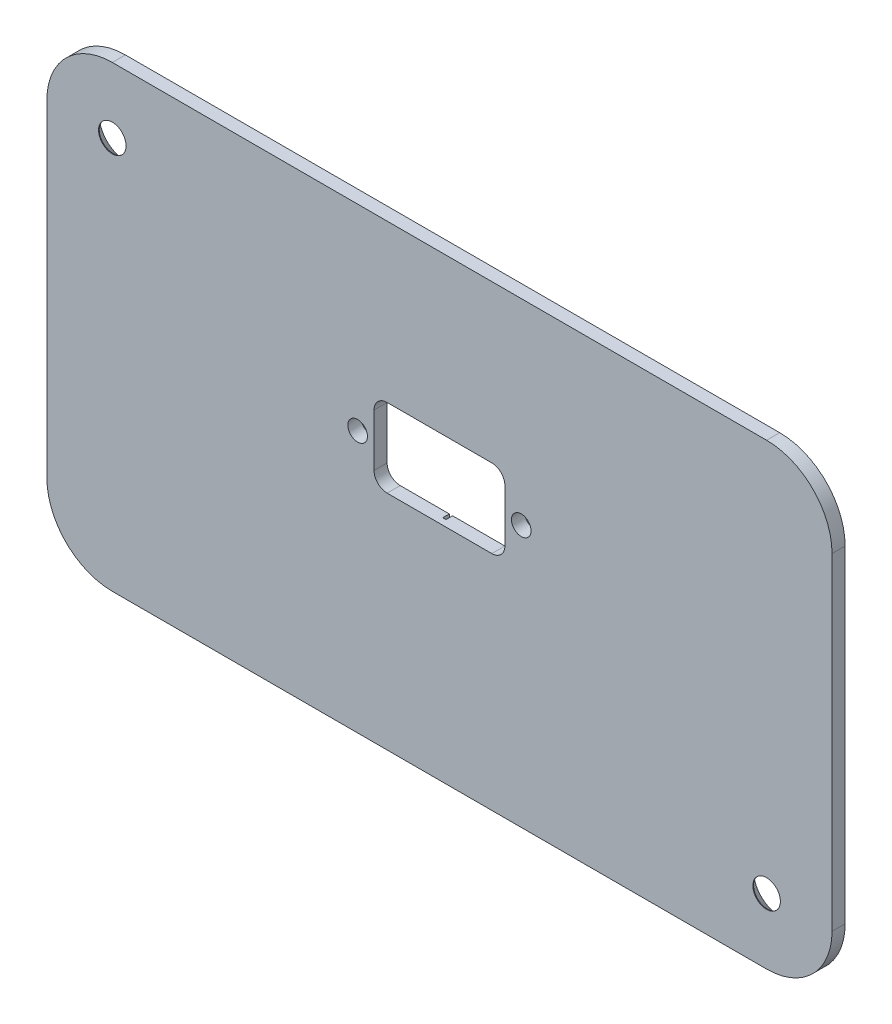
from build123d import *

# Parameters (mm, degrees)
ESQUISSE1_W             = 120
ESQUISSE1_H             = 70
BOSS_EXTRU_1_DEPTH      = 2
CONG_1_R                = 10
ESQUISSE2_R             = 2.1
ENL_V_MAT_EXTRU_1_DEPTH = 139.938835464
CHANFREIN2_SIZE         = 1.9
ESQUISSE3_R             = 1.5
ESQUISSE3_W             = 20
ESQUISSE3_H             = 12
ENL_V_MAT_EXTRU_2_DEPTH = 139.938835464
CONG_2_R                = 2
ESQUISSE4_W             = 0.5
ESQUISSE4_H             = 8.427596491
ENL_V_MAT_EXTRU_5_DEPTH = 1


with BuildPart() as part:
    # Esquisse1 → Boss.-Extru.1 (new body)
    with BuildSketch(Plane.XY):
        with Locations((60, 35)):
            Rectangle(ESQUISSE1_W, ESQUISSE1_H)
    extrude(amount=BOSS_EXTRU_1_DEPTH)

    # Cong_1
    cong_1_edges = [part.edges().sort_by_distance(p)[0] for p in [
        (0, 70, 1),
        (120, 70, 1),
        (120, 0, 1),
        (0, 0, 1),
    ]]
    fillet(cong_1_edges, radius=CONG_1_R)

    # Esquisse2 → Enl_v. mat.-Extru.1 (cut, through all)
    with BuildSketch(Plane.XY.offset(2)):
        with Locations((10, 60)):
            Circle(ESQUISSE2_R)
        with Locations((110, 10)):
            Circle(ESQUISSE2_R)
    extrude(amount=-ENL_V_MAT_EXTRU_1_DEPTH, mode=Mode.SUBTRACT)

    # Chanfrein2
    chanfrein2_edges = [part.edges().sort_by_distance(p)[0] for p in [
        (7.9, 60, 0),
        (107.9, 10, 0),
    ]]
    chamfer(chanfrein2_edges, length=CHANFREIN2_SIZE)

    # Esquisse3 → Enl_v. mat.-Extru.2 (cut, through all)
    with BuildSketch(Plane(origin=(0, 0, 0), x_dir=(-1, 0, 0), z_dir=(0, 0, -1))):
        with Locations((-72.5, 40)):
            Circle(ESQUISSE3_R)
        with Locations((-47.5, 40)):
            Circle(ESQUISSE3_R)
        with Locations((-60, 40)):
            Rectangle(ESQUISSE3_W, ESQUISSE3_H)
    extrude(amount=-ENL_V_MAT_EXTRU_2_DEPTH, mode=Mode.SUBTRACT)

    # Cong_2
    cong_2_edges = [part.edges().sort_by_distance(p)[0] for p in [
        (70, 34, 1),
        (70, 46, 1),
        (50, 46, 1),
        (50, 34, 1),
    ]]
    fillet(cong_2_edges, radius=CONG_2_R)

    # Esquisse4 → Enl_v. mat.-Extru.5 (cut)
    # profile 1 of 10: a face of its own
    with BuildSketch(Plane(origin=(0, 0, 0), x_dir=(-1, 0, 0), z_dir=(0, 0, -1))):
        with Locations((-59.75, 29.786201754)):
            Rectangle(ESQUISSE4_W, ESQUISSE4_H)
    # profile 2 of 10: a face of its own
    with BuildSketch(Plane(origin=(0, 0, 0), x_dir=(-1, 0, 0), z_dir=(0, 0, -1))):
        Polygon((-79.763617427, 29.072403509), (-79.11648201, 29.072403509), (-79.11648201, 25.572403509), (-79.430584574, 25.572403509), (-79.430584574, 28.71342915), (-79.969046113, 28.71342915), align=None)
    # profile 3 of 10: a face of its own
    with BuildSketch(Plane(origin=(0, 0, 0), x_dir=(-1, 0, 0), z_dir=(0, 0, -1))):
        with BuildLine():
            Line((-77.36648201, 27.995480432), (-77.680584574, 27.995480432))
            add(Edge.make_bspline(
                [(-77.680584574, 27.995480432), (-77.678537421, 28.03715132), (-77.674516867, 28.118991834), (-77.655688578, 28.238315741), (-77.628747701, 28.35237054), (-77.590656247, 28.460240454), (-77.543349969, 28.562879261), (-77.486619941, 28.659879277), (-77.419426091, 28.750870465), (-77.343219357, 28.835009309), (-77.260450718, 28.912196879), (-77.171144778, 28.978852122), (-77.077299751, 29.035169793), (-76.979200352, 29.082251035), (-76.875739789, 29.117590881), (-76.767856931, 29.143812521), (-76.655077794, 29.159588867), (-76.578237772, 29.161284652), (-76.539158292, 29.162147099)],
                knots=[0, 0, 0, 0, 1.10065271, 2.161652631, 3.183658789, 4.190468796, 5.17591951, 6.163126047, 7.15150782, 8.156236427, 9.156009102, 10.134482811, 11.092018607, 12.041330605, 13.001268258, 13.972401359, 14.968799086, 16, 16, 16, 16], degree=3))
            add(Edge.make_bspline(
                [(-76.539158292, 29.162147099), (-76.500780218, 29.161248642), (-76.425368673, 29.159483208), (-76.315306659, 29.144322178), (-76.210529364, 29.120576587), (-76.111241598, 29.08726117), (-76.018235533, 29.042476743), (-75.930812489, 28.988679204), (-75.847931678, 28.926459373), (-75.773324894, 28.853205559), (-75.704816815, 28.775003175), (-75.64571456, 28.691515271), (-75.595101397, 28.605285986), (-75.552913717, 28.515657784), (-75.521857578, 28.421786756), (-75.49827937, 28.325039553), (-75.484951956, 28.224414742), (-75.482906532, 28.156308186), (-75.481866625, 28.121682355)],
                knots=[0, 0, 0, 0, 1.111607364, 2.184268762, 3.212621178, 4.221274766, 5.211760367, 6.196651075, 7.1921475, 8.207485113, 9.220403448, 10.201281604, 11.166441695, 12.114753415, 13.065576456, 14.026450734, 14.996634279, 16, 16, 16, 16], degree=3))
            add(Edge.make_bspline(
                [(-75.481866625, 28.121682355), (-75.483559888, 28.072934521), (-75.4869167, 27.976294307), (-75.515631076, 27.834279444), (-75.560477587, 27.696686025), (-75.614474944, 27.585948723), (-75.668947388, 27.496715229), (-75.718034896, 27.423246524), (-75.775499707, 27.344141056), (-75.842178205, 27.259663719), (-75.916691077, 27.169152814), (-75.99971324, 27.072663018), (-76.091836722, 26.971191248), (-76.156495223, 26.901885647), (-76.189999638, 26.865973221)],
                knots=[0, 0, 0, 0, 1.184426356, 2.348067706, 3.509069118, 4.696110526, 5.333549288, 6.050745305, 6.844228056, 7.710549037, 8.667450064, 9.695053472, 10.805634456, 12, 12, 12, 12], degree=3))
            Line((-76.189999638, 26.865973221), (-77.06570076, 25.931377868))
            Line((-77.06570076, 25.931377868), (-75.436994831, 25.931377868))
            Line((-75.436994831, 25.931377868), (-75.436994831, 25.572403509))
            Line((-75.436994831, 25.572403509), (-77.815199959, 25.572403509))
            Line((-77.815199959, 25.572403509), (-76.457828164, 27.020921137))
            add(Edge.make_bspline(
                [(-76.457828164, 27.020921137), (-76.424780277, 27.055419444), (-76.36130205, 27.12168363), (-76.271519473, 27.218426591), (-76.190880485, 27.308176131), (-76.118863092, 27.39076268), (-76.057029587, 27.467394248), (-76.002157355, 27.535588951), (-75.958191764, 27.598343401), (-75.910476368, 27.671084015), (-75.864262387, 27.759896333), (-75.824550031, 27.868430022), (-75.800335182, 27.980157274), (-75.797430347, 28.055659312), (-75.79596919, 28.093637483)],
                knots=[0, 0, 0, 0, 1.329631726, 2.553950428, 3.673215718, 4.687767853, 5.603093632, 6.413772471, 7.123043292, 7.734684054, 8.834405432, 9.900288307, 10.943827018, 12, 12, 12, 12], degree=3))
            add(Edge.make_bspline(
                [(-75.79596919, 28.093637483), (-75.796604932, 28.117518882), (-75.797857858, 28.164584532), (-75.808915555, 28.233590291), (-75.825626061, 28.300155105), (-75.849571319, 28.364483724), (-75.88117806, 28.425929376), (-75.919651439, 28.484566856), (-75.964041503, 28.541255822), (-76.015392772, 28.59440912), (-76.071804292, 28.643090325), (-76.131398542, 28.686214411), (-76.194448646, 28.722253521), (-76.260688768, 28.751797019), (-76.329934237, 28.7749724), (-76.402318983, 28.791030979), (-76.477642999, 28.801113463), (-76.529076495, 28.802477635), (-76.555284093, 28.80317274)],
                knots=[0, 0, 0, 0, 0.991446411, 1.95395049, 2.89581595, 3.838931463, 4.798493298, 5.75982156, 6.748411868, 7.785213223, 8.824556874, 9.840280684, 10.836137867, 11.835679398, 12.848801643, 13.863922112, 14.911575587, 16, 16, 16, 16], degree=3))
            add(Edge.make_bspline(
                [(-76.555284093, 28.80317274), (-76.582654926, 28.802457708), (-76.636406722, 28.801053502), (-76.715325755, 28.791230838), (-76.790611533, 28.774284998), (-76.862453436, 28.751108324), (-76.930973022, 28.721649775), (-76.995837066, 28.68495803), (-77.056899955, 28.641174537), (-77.114276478, 28.591533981), (-77.167140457, 28.536266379), (-77.213587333, 28.474656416), (-77.254171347, 28.407829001), (-77.289580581, 28.33596445), (-77.318336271, 28.25841067), (-77.340309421, 28.175442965), (-77.357696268, 28.087421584), (-77.363504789, 28.026636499), (-77.36648201, 27.995480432)],
                knots=[0, 0, 0, 0, 1.031018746, 2.02475058, 2.990194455, 3.934040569, 4.864654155, 5.795059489, 6.735614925, 7.690564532, 8.649604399, 9.611025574, 10.590972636, 11.591080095, 12.624614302, 13.701020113, 14.821632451, 16, 16, 16, 16], degree=3))
        make_face()
    # profile 4 of 10: a face of its own
    with BuildSketch(Plane(origin=(0, 0, 0), x_dir=(-1, 0, 0), z_dir=(0, 0, -1))):
        with BuildLine():
            Line((-70.231866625, 28.430175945), (-70.506706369, 28.219839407))
            add(Edge.make_bspline(
                [(-70.506706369, 28.219839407), (-70.526312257, 28.243205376), (-70.565259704, 28.289622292), (-70.627918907, 28.354801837), (-70.69322055, 28.415867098), (-70.761139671, 28.473108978), (-70.83289879, 28.524525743), (-70.906759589, 28.572796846), (-70.983957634, 28.616064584), (-71.090709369, 28.66852757), (-71.230357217, 28.723273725), (-71.406152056, 28.769176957), (-71.589663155, 28.798398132), (-71.714860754, 28.801562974), (-71.778541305, 28.80317274)],
                knots=[0, 0, 0, 0, 0.757959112, 1.505699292, 2.245454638, 2.979532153, 3.711538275, 4.438200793, 5.171680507, 5.909471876, 7.393775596, 8.890124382, 10.418191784, 12, 12, 12, 12], degree=3))
            add(Edge.make_bspline(
                [(-71.778541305, 28.80317274), (-71.813624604, 28.802768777), (-71.883465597, 28.801964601), (-71.98711407, 28.791355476), (-72.088827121, 28.776444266), (-72.188538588, 28.754318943), (-72.286121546, 28.726346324), (-72.382213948, 28.69292091), (-72.475424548, 28.65156607), (-72.567042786, 28.60585781), (-72.654821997, 28.554230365), (-72.737877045, 28.497917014), (-72.815905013, 28.437547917), (-72.888967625, 28.372896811), (-72.957139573, 28.30425485), (-73.019926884, 28.230890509), (-73.077112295, 28.153038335), (-73.12982932, 28.071724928), (-73.177042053, 27.987187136), (-73.216571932, 27.899112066), (-73.251577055, 27.809007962), (-73.279276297, 27.715856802), (-73.301200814, 27.620314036), (-73.316328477, 27.522123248), (-73.326816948, 27.421489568), (-73.327617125, 27.353280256), (-73.328020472, 27.3188979)],
                knots=[0, 0, 0, 0, 1.054917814, 2.100044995, 3.131103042, 4.146048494, 5.169673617, 6.183595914, 7.203665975, 8.234915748, 9.262203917, 10.264457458, 11.251630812, 12.227803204, 13.197192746, 14.159520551, 15.12972552, 16.100847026, 17.073214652, 18.039054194, 19.002613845, 19.979014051, 20.95965708, 21.949030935, 22.966165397, 24, 24, 24, 24], degree=3))
            add(Edge.make_bspline(
                [(-73.328020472, 27.3188979), (-73.326758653, 27.26716658), (-73.324281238, 27.165598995), (-73.302232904, 27.016828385), (-73.268727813, 26.874307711), (-73.218512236, 26.738927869), (-73.156593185, 26.609019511), (-73.078352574, 26.486780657), (-72.987736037, 26.370364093), (-72.883461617, 26.262521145), (-72.769055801, 26.16400742), (-72.646307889, 26.077256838), (-72.515523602, 26.004941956), (-72.378146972, 25.944766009), (-72.233120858, 25.898509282), (-72.080706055, 25.865945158), (-71.92123406, 25.844702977), (-71.81226466, 25.842669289), (-71.756806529, 25.841634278)],
                knots=[0, 0, 0, 0, 1.029171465, 2.020641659, 2.987623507, 3.938342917, 4.889210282, 5.84687017, 6.821220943, 7.821438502, 8.827599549, 9.822697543, 10.807740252, 11.797342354, 12.80366471, 13.83203677, 14.896651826, 16, 16, 16, 16], degree=3))
            add(Edge.make_bspline(
                [(-71.756806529, 25.841634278), (-71.69570384, 25.843323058), (-71.575439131, 25.846646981), (-71.399071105, 25.87480623), (-71.230235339, 25.920464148), (-71.068922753, 25.98436207), (-70.915588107, 26.067427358), (-70.769991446, 26.168125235), (-70.632009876, 26.287413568), (-70.549038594, 26.378496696), (-70.506706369, 26.424967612)],
                knots=[0, 0, 0, 0, 1.028121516, 2.023589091, 2.998037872, 3.967518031, 4.937445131, 5.927275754, 6.942489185, 8, 8, 8, 8], degree=3))
            Line((-70.506706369, 26.424967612), (-70.231866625, 26.216734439))
            add(Edge.make_bspline(
                [(-70.231866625, 26.216734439), (-70.253984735, 26.188195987), (-70.298115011, 26.13125578), (-70.369573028, 26.050984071), (-70.444850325, 25.975480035), (-70.524506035, 25.905352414), (-70.607623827, 25.839197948), (-70.695696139, 25.778896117), (-70.787565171, 25.723605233), (-70.88291965, 25.672978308), (-70.981658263, 25.628061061), (-71.083662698, 25.589607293), (-71.188493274, 25.556482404), (-71.296154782, 25.529230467), (-71.406870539, 25.507959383), (-71.520241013, 25.493739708), (-71.636510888, 25.483997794), (-71.714952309, 25.483109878), (-71.754703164, 25.482659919)],
                knots=[0, 0, 0, 0, 0.986787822, 1.968848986, 2.935600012, 3.899624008, 4.868462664, 5.837806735, 6.815139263, 7.798259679, 8.787526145, 9.778297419, 10.776456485, 11.791383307, 12.812564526, 13.85620153, 14.913611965, 16, 16, 16, 16], degree=3))
            add(Edge.make_bspline(
                [(-71.754703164, 25.482659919), (-71.792346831, 25.482921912), (-71.866782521, 25.48343997), (-71.976681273, 25.491832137), (-72.083670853, 25.503281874), (-72.187445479, 25.520522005), (-72.288571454, 25.540866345), (-72.386132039, 25.568137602), (-72.481087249, 25.598686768), (-72.57305559, 25.634591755), (-72.66211529, 25.675107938), (-72.747979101, 25.720899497), (-72.830607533, 25.771581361), (-72.910812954, 25.826036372), (-72.987410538, 25.886013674), (-73.061064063, 25.950680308), (-73.13218654, 26.019818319), (-73.176189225, 26.069673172), (-73.19831294, 26.094739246)],
                knots=[0, 0, 0, 0, 1.114604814, 2.203992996, 3.262667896, 4.300477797, 5.318619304, 6.316056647, 7.298880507, 8.271930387, 9.238335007, 10.195173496, 11.151986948, 12.108099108, 13.064862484, 14.031167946, 15.010108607, 16, 16, 16, 16], degree=3))
            add(Edge.make_bspline(
                [(-73.19831294, 26.094739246), (-73.233748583, 26.138280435), (-73.30419206, 26.224837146), (-73.394317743, 26.365123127), (-73.471465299, 26.511591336), (-73.533841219, 26.665011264), (-73.582603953, 26.825038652), (-73.616385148, 26.991754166), (-73.638336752, 27.165002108), (-73.640847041, 27.282838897), (-73.642123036, 27.342736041)],
                knots=[0, 0, 0, 0, 0.994628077, 1.977248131, 2.950237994, 3.925870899, 4.908910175, 5.911660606, 6.938484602, 8, 8, 8, 8], degree=3))
            add(Edge.make_bspline(
                [(-73.642123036, 27.342736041), (-73.640567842, 27.405691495), (-73.637508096, 27.529552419), (-73.6115123, 27.711326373), (-73.569693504, 27.885477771), (-73.510296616, 28.051681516), (-73.434991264, 28.210811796), (-73.34196465, 28.361653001), (-73.232297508, 28.505169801), (-73.106849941, 28.639184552), (-72.969282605, 28.761723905), (-72.821963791, 28.869530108), (-72.665181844, 28.959247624), (-72.500663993, 29.034243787), (-72.327178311, 29.09188825), (-72.145094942, 29.132241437), (-71.954756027, 29.157358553), (-71.824893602, 29.160533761), (-71.758909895, 29.162147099)],
                knots=[0, 0, 0, 0, 1.032925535, 2.032216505, 3.007276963, 3.968222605, 4.92396291, 5.891752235, 6.871517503, 7.883894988, 8.900124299, 9.891468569, 10.874487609, 11.85992873, 12.854644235, 13.869047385, 14.917252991, 16, 16, 16, 16], degree=3))
            add(Edge.make_bspline(
                [(-71.758909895, 29.162147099), (-71.718695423, 29.161664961), (-71.639094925, 29.160710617), (-71.521342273, 29.151404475), (-71.406699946, 29.135890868), (-71.295088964, 29.114774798), (-71.185966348, 29.088567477), (-71.080166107, 29.054427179), (-70.97706742, 29.015390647), (-70.877320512, 28.970432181), (-70.781403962, 28.91996544), (-70.689347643, 28.864549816), (-70.601882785, 28.804254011), (-70.518393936, 28.739590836), (-70.440277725, 28.669192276), (-70.365316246, 28.59499468), (-70.296055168, 28.514860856), (-70.253301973, 28.458455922), (-70.231866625, 28.430175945)],
                knots=[0, 0, 0, 0, 1.096760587, 2.17092713, 3.219439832, 4.250915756, 5.268269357, 6.278326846, 7.281116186, 8.274029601, 9.260640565, 10.235837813, 11.203064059, 12.156899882, 13.114053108, 14.069676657, 15.032185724, 16, 16, 16, 16], degree=3))
        make_face()
    # profile 5 of 10: a face of its own
    with BuildSketch(Plane(origin=(0, 0, 0), x_dir=(-1, 0, 0), z_dir=(0, 0, -1))):
        Polygon((-69.513917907, 29.072403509), (-67.808789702, 29.072403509), (-67.808789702, 28.71342915), (-69.199815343, 28.71342915), (-69.199815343, 27.636506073), (-67.808789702, 27.636506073), (-67.808789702, 27.277531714), (-69.199815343, 27.277531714), (-69.199815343, 25.572403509), (-69.513917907, 25.572403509), align=None)
    # profile 6 of 10: a face of its own
    with BuildSketch(Plane(origin=(0, 0, 0), x_dir=(-1, 0, 0), z_dir=(0, 0, -1))):
        Polygon((-65.744687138, 29.072403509), (-64.129302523, 25.572403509), (-64.470748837, 25.572403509), (-64.988176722, 26.694198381), (-66.574815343, 26.694198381), (-67.106966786, 25.572403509), (-67.449815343, 25.572403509), (-65.789558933, 29.072403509), align=None)
        Polygon((-65.770628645, 28.390212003), (-66.404442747, 27.05317274), (-65.153641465, 27.05317274), align=None, mode=Mode.SUBTRACT)
    # profile 7 of 10: a face of its own
    with BuildSketch(Plane(origin=(0, 0, 0), x_dir=(-1, 0, 0), z_dir=(0, 0, -1))):
        Polygon((-53.883940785, 29.072403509), (-53.236805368, 29.072403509), (-53.236805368, 25.572403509), (-53.550907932, 25.572403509), (-53.550907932, 28.71342915), (-54.089369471, 28.71342915), align=None)
    # profile 8 of 10: a face of its own
    with BuildSketch(Plane(origin=(0, 0, 0), x_dir=(-1, 0, 0), z_dir=(0, 0, -1))):
        Polygon((-50.499625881, 29.072403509), (-50.17500649, 29.072403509), (-49.490010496, 26.505596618), (-48.471280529, 29.072403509), (-48.425707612, 29.072403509), (-47.425907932, 26.523124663), (-46.73740633, 29.072403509), (-46.416292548, 29.072403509), (-47.360002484, 25.572403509), (-47.404874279, 25.572403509), (-48.457959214, 28.249286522), (-49.523664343, 25.572403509), (-49.568536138, 25.572403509), align=None)
    # profile 9 of 10: a face of its own
    with BuildSketch(Plane(origin=(0, 0, 0), x_dir=(-1, 0, 0), z_dir=(0, 0, -1))):
        Polygon((-46.012446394, 29.072403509), (-45.687827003, 29.072403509), (-45.002831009, 26.505596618), (-43.984101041, 29.072403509), (-43.938528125, 29.072403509), (-42.938728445, 26.523124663), (-42.250226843, 29.072403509), (-41.929113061, 29.072403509), (-42.872822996, 25.572403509), (-42.917694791, 25.572403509), (-43.970779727, 28.249286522), (-45.036484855, 25.572403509), (-45.08135665, 25.572403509), align=None)
    # profile 10 of 10: a face of its own
    with BuildSketch(Plane(origin=(0, 0, 0), x_dir=(-1, 0, 0), z_dir=(0, 0, -1))):
        Polygon((-39.865010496, 29.072403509), (-38.249625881, 25.572403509), (-38.591072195, 25.572403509), (-39.10850008, 26.694198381), (-40.695138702, 26.694198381), (-41.227290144, 25.572403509), (-41.570138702, 25.572403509), (-39.909882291, 29.072403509), align=None)
        Polygon((-39.890952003, 28.390212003), (-40.524766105, 27.05317274), (-39.273964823, 27.05317274), align=None, mode=Mode.SUBTRACT)
    extrude(amount=-ENL_V_MAT_EXTRU_5_DEPTH, mode=Mode.SUBTRACT)


solid = part.part
